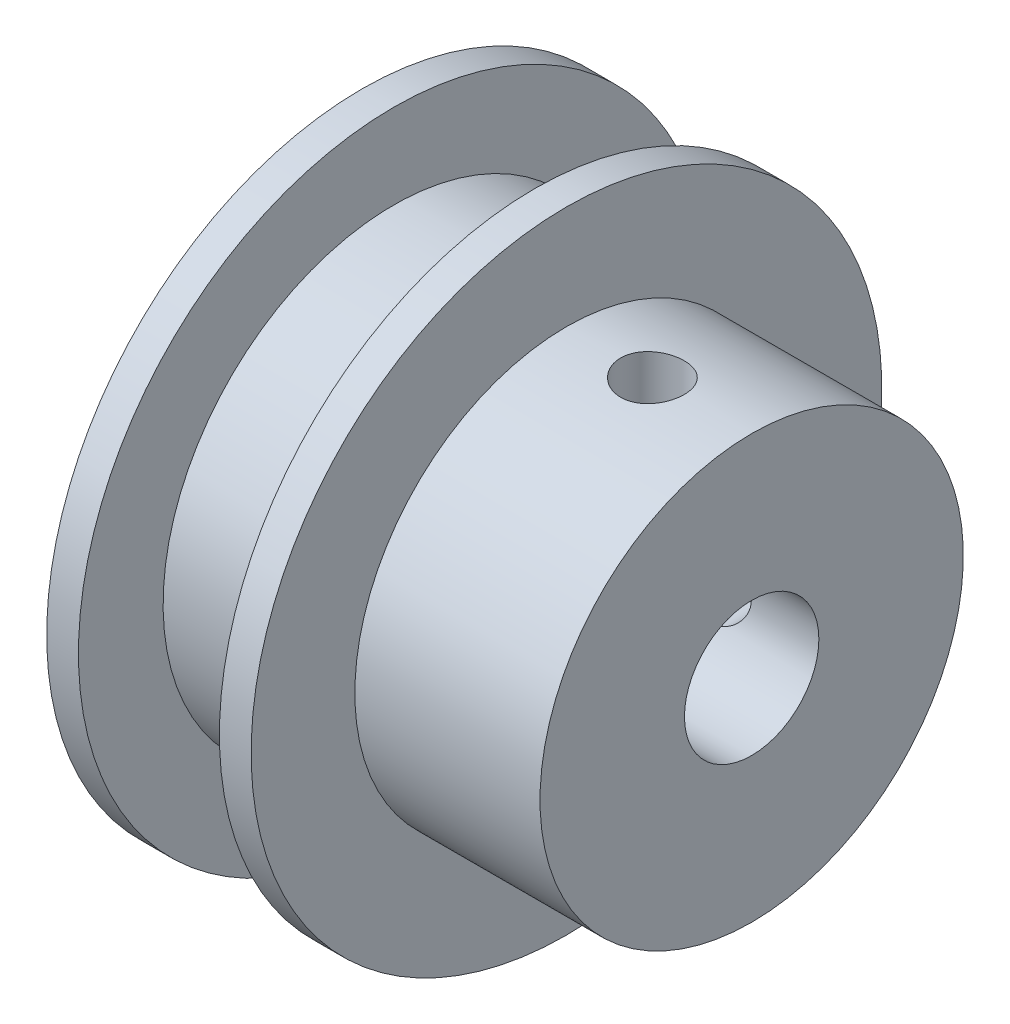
ISO-10303-21;
HEADER;
FILE_DESCRIPTION(('STEP AP214'),'2;1');
FILE_NAME('part.step','',(''),(''),'','','');
FILE_SCHEMA(('AUTOMOTIVE_DESIGN { 1 0 10303 214 1 1 1 1 }'));
ENDSEC;
DATA;
#1=APPLICATION_CONTEXT('core data for automotive mechanical design processes');
#2=APPLICATION_PROTOCOL_DEFINITION('international standard','automotive_design',2000,#1);
#3=PRODUCT_CONTEXT('',#1,'mechanical');
#4=PRODUCT('Part','Part','',(#3));
#5=PRODUCT_RELATED_PRODUCT_CATEGORY('part','',(#4));
#6=PRODUCT_DEFINITION_FORMATION('','',#4);
#7=PRODUCT_DEFINITION_CONTEXT('part definition',#1,'design');
#8=PRODUCT_DEFINITION('design','',#6,#7);
#9=PRODUCT_DEFINITION_SHAPE('','',#8);
#10=(LENGTH_UNIT() NAMED_UNIT(*) SI_UNIT(.MILLI.,.METRE.));
#11=(NAMED_UNIT(*) PLANE_ANGLE_UNIT() SI_UNIT($,.RADIAN.));
#12=(NAMED_UNIT(*) SI_UNIT($,.STERADIAN.) SOLID_ANGLE_UNIT());
#13=UNCERTAINTY_MEASURE_WITH_UNIT(LENGTH_MEASURE(1.E-05),#10,'distance_accuracy_value','');
#14=(GEOMETRIC_REPRESENTATION_CONTEXT(3) GLOBAL_UNCERTAINTY_ASSIGNED_CONTEXT((#13)) GLOBAL_UNIT_ASSIGNED_CONTEXT((#10,
#11,#12)) REPRESENTATION_CONTEXT('',''));
#15=CARTESIAN_POINT('',(0.,0.,0.));
#16=DIRECTION('',(0.,0.,1.));
#17=DIRECTION('',(1.,0.,0.));
#18=AXIS2_PLACEMENT_3D('',#15,#16,#17);
#19=CARTESIAN_POINT('',(-4.83,-10.9,0.));
#20=DIRECTION('',(-1.,0.,0.));
#21=DIRECTION('',(0.,-1.,0.));
#22=AXIS2_PLACEMENT_3D('',#19,#20,#21);
#23=CYLINDRICAL_SURFACE('',#22,14.9);
#24=CARTESIAN_POINT('',(3.33,-10.9,0.));
#25=DIRECTION('',(-1.,0.,0.));
#26=DIRECTION('',(0.,-1.,0.));
#27=AXIS2_PLACEMENT_3D('',#24,#25,#26);
#28=CIRCLE('',#27,14.9);
#29=CARTESIAN_POINT('',(3.33,-25.8,0.));
#30=VERTEX_POINT('',#29);
#31=EDGE_CURVE('E10',#30,#30,#28,.T.);
#32=ORIENTED_EDGE('',*,*,#31,.F.);
#33=EDGE_LOOP('',(#32));
#34=FACE_BOUND('',#33,.T.);
#35=CARTESIAN_POINT('',(4.83,-10.9,0.));
#36=DIRECTION('',(-1.,0.,0.));
#37=DIRECTION('',(0.,-1.,0.));
#38=AXIS2_PLACEMENT_3D('',#35,#36,#37);
#39=CIRCLE('',#38,14.9);
#40=CARTESIAN_POINT('',(4.83,-25.8,0.));
#41=VERTEX_POINT('',#40);
#42=EDGE_CURVE('E61',#41,#41,#39,.T.);
#43=ORIENTED_EDGE('',*,*,#42,.T.);
#44=EDGE_LOOP('',(#43));
#45=FACE_BOUND('',#44,.T.);
#46=ADVANCED_FACE('F36',(#34,#45),#23,.T.);
#47=CARTESIAN_POINT('',(3.33,4.,0.));
#48=DIRECTION('',(1.,0.,0.));
#49=DIRECTION('',(0.,1.,0.));
#50=AXIS2_PLACEMENT_3D('',#47,#48,#49);
#51=PLANE('',#50);
#52=CARTESIAN_POINT('',(3.33,-10.9,0.));
#53=DIRECTION('',(-1.,0.,0.));
#54=DIRECTION('',(0.,-1.,0.));
#55=AXIS2_PLACEMENT_3D('',#52,#53,#54);
#56=CIRCLE('',#55,10.9);
#57=CARTESIAN_POINT('',(3.33,-21.8,0.));
#58=VERTEX_POINT('',#57);
#59=EDGE_CURVE('E49',#58,#58,#56,.T.);
#60=ORIENTED_EDGE('',*,*,#59,.F.);
#61=EDGE_LOOP('',(#60));
#62=FACE_BOUND('',#61,.T.);
#63=ORIENTED_EDGE('',*,*,#31,.T.);
#64=EDGE_LOOP('',(#63));
#65=FACE_BOUND('',#64,.T.);
#66=ADVANCED_FACE('F107',(#62,#65),#51,.F.);
#67=CARTESIAN_POINT('',(-4.83,-10.9,0.));
#68=DIRECTION('',(-1.,0.,0.));
#69=DIRECTION('',(0.,-1.,0.));
#70=AXIS2_PLACEMENT_3D('',#67,#68,#69);
#71=CYLINDRICAL_SURFACE('',#70,10.9);
#72=CARTESIAN_POINT('',(-3.33,-10.9,0.));
#73=DIRECTION('',(-1.,0.,0.));
#74=DIRECTION('',(0.,-1.,0.));
#75=AXIS2_PLACEMENT_3D('',#72,#73,#74);
#76=CIRCLE('',#75,10.9);
#77=CARTESIAN_POINT('',(-3.33,-21.8,0.));
#78=VERTEX_POINT('',#77);
#79=EDGE_CURVE('E55',#78,#78,#76,.T.);
#80=ORIENTED_EDGE('',*,*,#79,.F.);
#81=EDGE_LOOP('',(#80));
#82=FACE_BOUND('',#81,.T.);
#83=ORIENTED_EDGE('',*,*,#59,.T.);
#84=EDGE_LOOP('',(#83));
#85=FACE_BOUND('',#84,.T.);
#86=ADVANCED_FACE('F104',(#82,#85),#71,.T.);
#87=CARTESIAN_POINT('',(-3.33,0.,0.));
#88=DIRECTION('',(-1.,0.,0.));
#89=DIRECTION('',(0.,-1.,0.));
#90=AXIS2_PLACEMENT_3D('',#87,#88,#89);
#91=PLANE('',#90);
#92=CARTESIAN_POINT('',(-3.33,-10.9,0.));
#93=DIRECTION('',(-1.,0.,0.));
#94=DIRECTION('',(0.,-1.,0.));
#95=AXIS2_PLACEMENT_3D('',#92,#93,#94);
#96=CIRCLE('',#95,14.9);
#97=CARTESIAN_POINT('',(-3.33,-25.8,0.));
#98=VERTEX_POINT('',#97);
#99=EDGE_CURVE('E95',#98,#98,#96,.T.);
#100=ORIENTED_EDGE('',*,*,#99,.F.);
#101=EDGE_LOOP('',(#100));
#102=FACE_BOUND('',#101,.T.);
#103=ORIENTED_EDGE('',*,*,#79,.T.);
#104=EDGE_LOOP('',(#103));
#105=FACE_BOUND('',#104,.T.);
#106=ADVANCED_FACE('F102',(#102,#105),#91,.F.);
#107=CARTESIAN_POINT('',(-4.83,-10.9,0.));
#108=DIRECTION('',(-1.,0.,0.));
#109=DIRECTION('',(0.,-1.,0.));
#110=AXIS2_PLACEMENT_3D('',#107,#108,#109);
#111=CYLINDRICAL_SURFACE('',#110,14.9);
#112=CARTESIAN_POINT('',(-4.83,-10.9,0.));
#113=DIRECTION('',(-1.,0.,0.));
#114=DIRECTION('',(0.,-1.,0.));
#115=AXIS2_PLACEMENT_3D('',#112,#113,#114);
#116=CIRCLE('',#115,14.9);
#117=CARTESIAN_POINT('',(-4.83,-25.8,0.));
#118=VERTEX_POINT('',#117);
#119=EDGE_CURVE('E91',#118,#118,#116,.T.);
#120=ORIENTED_EDGE('',*,*,#119,.F.);
#121=EDGE_LOOP('',(#120));
#122=FACE_BOUND('',#121,.T.);
#123=ORIENTED_EDGE('',*,*,#99,.T.);
#124=EDGE_LOOP('',(#123));
#125=FACE_BOUND('',#124,.T.);
#126=ADVANCED_FACE('F119',(#122,#125),#111,.T.);
#127=CARTESIAN_POINT('',(-4.83,4.,0.));
#128=DIRECTION('',(1.,0.,0.));
#129=DIRECTION('',(0.,1.,0.));
#130=AXIS2_PLACEMENT_3D('',#127,#128,#129);
#131=PLANE('',#130);
#132=CARTESIAN_POINT('',(-4.83,-10.9,0.));
#133=DIRECTION('',(1.,0.,0.));
#134=DIRECTION('',(0.,1.,0.));
#135=AXIS2_PLACEMENT_3D('',#132,#133,#134);
#136=CIRCLE('',#135,3.175);
#137=CARTESIAN_POINT('',(-4.83,-7.725,0.));
#138=VERTEX_POINT('',#137);
#139=EDGE_CURVE('E62',#138,#138,#136,.T.);
#140=ORIENTED_EDGE('',*,*,#139,.T.);
#141=EDGE_LOOP('',(#140));
#142=FACE_BOUND('',#141,.T.);
#143=ORIENTED_EDGE('',*,*,#119,.T.);
#144=EDGE_LOOP('',(#143));
#145=FACE_BOUND('',#144,.T.);
#146=ADVANCED_FACE('F123',(#142,#145),#131,.F.);
#147=CARTESIAN_POINT('',(13.58,-10.9,0.));
#148=DIRECTION('',(-1.,0.,0.));
#149=DIRECTION('',(0.,-1.,0.));
#150=AXIS2_PLACEMENT_3D('',#147,#148,#149);
#151=PLANE('',#150);
#152=CARTESIAN_POINT('',(13.58,-10.9,0.));
#153=DIRECTION('',(-1.,0.,0.));
#154=DIRECTION('',(0.,-1.,0.));
#155=AXIS2_PLACEMENT_3D('',#152,#153,#154);
#156=CIRCLE('',#155,3.175);
#157=CARTESIAN_POINT('',(13.58,-14.075,0.));
#158=VERTEX_POINT('',#157);
#159=EDGE_CURVE('E58',#158,#158,#156,.T.);
#160=ORIENTED_EDGE('',*,*,#159,.T.);
#161=EDGE_LOOP('',(#160));
#162=FACE_BOUND('',#161,.T.);
#163=CARTESIAN_POINT('',(13.58,-10.9,0.));
#164=DIRECTION('',(-1.,0.,0.));
#165=DIRECTION('',(0.,-1.,0.));
#166=AXIS2_PLACEMENT_3D('',#163,#164,#165);
#167=CIRCLE('',#166,9.999999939);
#168=CARTESIAN_POINT('',(13.58,-20.899999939,0.));
#169=VERTEX_POINT('',#168);
#170=EDGE_CURVE('E87',#169,#169,#167,.T.);
#171=ORIENTED_EDGE('',*,*,#170,.F.);
#172=EDGE_LOOP('',(#171));
#173=FACE_BOUND('',#172,.T.);
#174=ADVANCED_FACE('F127',(#162,#173),#151,.F.);
#175=CARTESIAN_POINT('',(-4.83,-10.9,0.));
#176=DIRECTION('',(-1.,0.,0.));
#177=DIRECTION('',(0.,-1.,0.));
#178=AXIS2_PLACEMENT_3D('',#175,#176,#177);
#179=CYLINDRICAL_SURFACE('',#178,9.99999993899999);
#180=CARTESIAN_POINT('',(8.89,-1.01314009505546,1.5));
#181=CARTESIAN_POINT('',(8.80625443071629,-1.01313869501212,1.49999654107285));
#182=CARTESIAN_POINT('',(8.72246024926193,-1.0120645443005,1.49296296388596));
#183=CARTESIAN_POINT('',(8.55721468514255,-1.00788691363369,1.46502196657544));
#184=CARTESIAN_POINT('',(8.47576566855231,-1.00478145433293,1.4441010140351));
#185=CARTESIAN_POINT('',(8.31762624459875,-0.996900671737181,1.38902526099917));
#186=CARTESIAN_POINT('',(8.24093223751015,-0.992126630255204,1.35488061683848));
#187=CARTESIAN_POINT('',(8.09437296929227,-0.981448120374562,1.27435063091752));
#188=CARTESIAN_POINT('',(8.02450676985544,-0.975543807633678,1.22796697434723));
#189=CARTESIAN_POINT('',(7.89301618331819,-0.963217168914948,1.12387902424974));
#190=CARTESIAN_POINT('',(7.83145438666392,-0.956791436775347,1.06609605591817));
#191=CARTESIAN_POINT('',(7.71886251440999,-0.944176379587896,0.941019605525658));
#192=CARTESIAN_POINT('',(7.66783301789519,-0.937987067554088,0.873725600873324));
#193=CARTESIAN_POINT('',(7.57752336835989,-0.926506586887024,0.731136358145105));
#194=CARTESIAN_POINT('',(7.53830084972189,-0.921219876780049,0.655804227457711));
#195=CARTESIAN_POINT('',(7.47308840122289,-0.912177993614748,0.499528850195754));
#196=CARTESIAN_POINT('',(7.44709777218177,-0.908422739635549,0.41858590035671));
#197=CARTESIAN_POINT('',(7.40927661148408,-0.902890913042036,0.254031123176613));
#198=CARTESIAN_POINT('',(7.39734127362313,-0.901099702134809,0.170443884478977));
#199=CARTESIAN_POINT('',(7.38764406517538,-0.899647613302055,0.0024352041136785));
#200=CARTESIAN_POINT('',(7.38988140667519,-0.899986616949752,-0.0819861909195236));
#201=CARTESIAN_POINT('',(7.40838333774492,-0.902745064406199,-0.248551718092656));
#202=CARTESIAN_POINT('',(7.42453517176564,-0.905147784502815,-0.330708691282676));
#203=CARTESIAN_POINT('',(7.47023060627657,-0.911745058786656,-0.491132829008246));
#204=CARTESIAN_POINT('',(7.4997745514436,-0.915939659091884,-0.569399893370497));
#205=CARTESIAN_POINT('',(7.57153099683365,-0.9256781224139,-0.720163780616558));
#206=CARTESIAN_POINT('',(7.61379096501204,-0.931227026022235,-0.792637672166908));
#207=CARTESIAN_POINT('',(7.70974519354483,-0.943055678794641,-0.929507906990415));
#208=CARTESIAN_POINT('',(7.7634402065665,-0.949335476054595,-0.993903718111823));
#209=CARTESIAN_POINT('',(7.88136844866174,-0.961998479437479,-1.11345448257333));
#210=CARTESIAN_POINT('',(7.94570012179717,-0.968382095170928,-1.16851232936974));
#211=CARTESIAN_POINT('',(8.08274107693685,-0.980473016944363,-1.26706599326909));
#212=CARTESIAN_POINT('',(8.15545041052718,-0.986180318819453,-1.31056173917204));
#213=CARTESIAN_POINT('',(8.30728396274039,-0.996272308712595,-1.38476964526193));
#214=CARTESIAN_POINT('',(8.38641313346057,-1.00065596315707,-1.41547182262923));
#215=CARTESIAN_POINT('',(8.54878525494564,-1.00758603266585,-1.46312336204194));
#216=CARTESIAN_POINT('',(8.63202791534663,-1.0101325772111,-1.48007369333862));
#217=CARTESIAN_POINT('',(8.79940008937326,-1.01307554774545,-1.4996072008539));
#218=CARTESIAN_POINT('',(8.88351318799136,-1.01349257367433,-1.50232803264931));
#219=CARTESIAN_POINT('',(9.0509941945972,-1.0121839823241,-1.4936905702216));
#220=CARTESIAN_POINT('',(9.13436212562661,-1.01045843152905,-1.48233271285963));
#221=CARTESIAN_POINT('',(9.29755981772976,-1.0050780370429,-1.44597702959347));
#222=CARTESIAN_POINT('',(9.37740520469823,-1.00143289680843,-1.42104778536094));
#223=CARTESIAN_POINT('',(9.53178409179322,-0.992632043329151,-1.35832831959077));
#224=CARTESIAN_POINT('',(9.6063173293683,-0.987476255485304,-1.32053746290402));
#225=CARTESIAN_POINT('',(9.74857326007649,-0.976186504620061,-1.23283678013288));
#226=CARTESIAN_POINT('',(9.81624044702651,-0.97004546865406,-1.18283784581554));
#227=CARTESIAN_POINT('',(9.94227285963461,-0.95749846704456,-1.07226416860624));
#228=CARTESIAN_POINT('',(10.0006375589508,-0.951092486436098,-1.01168882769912));
#229=CARTESIAN_POINT('',(10.1069026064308,-0.938673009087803,-0.881075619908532));
#230=CARTESIAN_POINT('',(10.1547117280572,-0.932663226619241,-0.810963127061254));
#231=CARTESIAN_POINT('',(10.2378729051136,-0.921771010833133,-0.663622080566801));
#232=CARTESIAN_POINT('',(10.2732253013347,-0.916888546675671,-0.586393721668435));
#233=CARTESIAN_POINT('',(10.3303237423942,-0.90881736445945,-0.427297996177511));
#234=CARTESIAN_POINT('',(10.3521196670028,-0.905622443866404,-0.345448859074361));
#235=CARTESIAN_POINT('',(10.3816478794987,-0.901260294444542,-0.179200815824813));
#236=CARTESIAN_POINT('',(10.3893810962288,-0.900092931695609,-0.0948020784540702));
#237=CARTESIAN_POINT('',(10.3905417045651,-0.899918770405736,0.0732645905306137));
#238=CARTESIAN_POINT('',(10.3841086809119,-0.900890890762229,0.156931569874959));
#239=CARTESIAN_POINT('',(10.3574186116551,-0.904843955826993,0.321979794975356));
#240=CARTESIAN_POINT('',(10.3371616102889,-0.907824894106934,0.403361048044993));
#241=CARTESIAN_POINT('',(10.283448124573,-0.915462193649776,0.561489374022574));
#242=CARTESIAN_POINT('',(10.2500013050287,-0.920117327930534,0.638239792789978));
#243=CARTESIAN_POINT('',(10.1708725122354,-0.930591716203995,0.785061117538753));
#244=CARTESIAN_POINT('',(10.1251901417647,-0.936411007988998,0.855131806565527));
#245=CARTESIAN_POINT('',(10.0223823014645,-0.948634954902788,0.987312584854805));
#246=CARTESIAN_POINT('',(9.96515377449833,-0.955044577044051,1.04934206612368));
#247=CARTESIAN_POINT('',(9.84109492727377,-0.967690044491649,1.16296808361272));
#248=CARTESIAN_POINT('',(9.77426235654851,-0.973925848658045,1.21456216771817));
#249=CARTESIAN_POINT('',(9.63245101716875,-0.985555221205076,1.30611310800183));
#250=CARTESIAN_POINT('',(9.55742858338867,-0.990943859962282,1.34600294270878));
#251=CARTESIAN_POINT('',(9.40170322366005,-1.00021097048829,1.41255613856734));
#252=CARTESIAN_POINT('',(9.32100629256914,-1.00409100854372,1.43923322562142));
#253=CARTESIAN_POINT('',(9.18162256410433,-1.00900520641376,1.47254951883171));
#254=CARTESIAN_POINT('',(9.12379660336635,-1.01054756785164,1.48282769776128));
#255=CARTESIAN_POINT('',(9.00732170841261,-1.01261549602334,1.49655410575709));
#256=CARTESIAN_POINT('',(8.94867278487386,-1.01314107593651,1.50000242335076));
#257=CARTESIAN_POINT('',(8.89,-1.01314009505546,1.5));
#258=B_SPLINE_CURVE_WITH_KNOTS('',3,(#180,#181,#182,#183,#184,#185,#186,#187,#188,#189,#190,
#191,#192,#193,#194,#195,#196,#197,#198,#199,#200,#201,#202,#203,#204,#205,#206,#207,#208,#209,
#210,#211,#212,#213,#214,#215,#216,#217,#218,#219,#220,#221,#222,#223,#224,#225,#226,#227,#228,
#229,#230,#231,#232,#233,#234,#235,#236,#237,#238,#239,#240,#241,#242,#243,#244,#245,#246,#247,
#248,#249,#250,#251,#252,#253,#254,#255,#256,#257),.UNSPECIFIED.,.T.,.F.,(4,2,2,2,2,2,2,2,2,2,2,
2,2,2,2,2,2,2,2,2,2,2,2,2,2,2,2,2,2,2,2,2,2,2,2,2,2,2,4),(0.,0.251022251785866,
0.502289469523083,0.753364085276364,1.00440414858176,1.25724158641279,1.51009292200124,
1.76415922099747,2.01821209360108,2.27035832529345,2.52249053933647,2.77259862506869,
3.02271314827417,3.27377316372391,3.52484970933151,3.77839544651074,4.03194274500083,
4.28568751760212,4.53941440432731,4.79068214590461,5.04194209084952,5.29194394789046,
5.5419581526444,5.79385485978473,6.04576581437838,6.29977537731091,6.55377799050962,
6.8068404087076,7.05988611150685,7.31044963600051,7.56101235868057,7.81139182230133,
8.06177941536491,8.31450949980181,8.567298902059,8.82150878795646,9.07545403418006,
9.25132441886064,9.42719252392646),.UNSPECIFIED.);
#259=CARTESIAN_POINT('',(8.89,-1.01314009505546,1.5));
#260=VERTEX_POINT('',#259);
#261=EDGE_CURVE('E136',#260,#260,#258,.T.);
#262=ORIENTED_EDGE('',*,*,#261,.T.);
#263=EDGE_LOOP('',(#262));
#264=FACE_BOUND('',#263,.T.);
#265=CARTESIAN_POINT('',(10.39,-10.9,-9.99999993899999));
#266=CARTESIAN_POINT('',(10.3899965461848,-10.9837515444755,-9.99999859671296));
#267=CARTESIAN_POINT('',(10.3829619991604,-11.0675516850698,-9.99893676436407));
#268=CARTESIAN_POINT('',(10.3550168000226,-11.2328096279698,-9.99480309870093));
#269=CARTESIAN_POINT('',(10.3340926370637,-11.3142650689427,-9.9917293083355));
#270=CARTESIAN_POINT('',(10.2790074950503,-11.4724180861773,-9.9839171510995));
#271=CARTESIAN_POINT('',(10.244856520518,-11.5491192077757,-9.97918004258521));
#272=CARTESIAN_POINT('',(10.1643116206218,-11.6956904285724,-9.96856469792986));
#273=CARTESIAN_POINT('',(10.11791939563,-11.7655614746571,-9.96268662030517));
#274=CARTESIAN_POINT('',(10.0138227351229,-11.8970467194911,-9.95039164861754));
#275=CARTESIAN_POINT('',(9.95604154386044,-11.9585998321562,-9.94397127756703));
#276=CARTESIAN_POINT('',(9.83097231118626,-12.0711749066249,-9.93134254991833));
#277=CARTESIAN_POINT('',(9.76368372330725,-12.1221962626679,-9.92513420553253));
#278=CARTESIAN_POINT('',(9.62109935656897,-12.2124972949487,-9.91359871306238));
#279=CARTESIAN_POINT('',(9.54576575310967,-12.2517178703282,-9.90827605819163));
#280=CARTESIAN_POINT('',(9.38948717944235,-12.3169263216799,-9.89916205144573));
#281=CARTESIAN_POINT('',(9.3085425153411,-12.3429149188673,-9.89537061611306));
#282=CARTESIAN_POINT('',(9.14398195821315,-12.3807319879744,-9.88978250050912));
#283=CARTESIAN_POINT('',(9.0603906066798,-12.392665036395,-9.88797109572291));
#284=CARTESIAN_POINT('',(8.89237383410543,-12.4023562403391,-9.88650342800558));
#285=CARTESIAN_POINT('',(8.80794846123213,-12.400115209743,-9.88684704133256));
#286=CARTESIAN_POINT('',(8.64139891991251,-12.3816073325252,-9.88963712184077));
#287=CARTESIAN_POINT('',(8.55926147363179,-12.3654569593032,-9.89206612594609));
#288=CARTESIAN_POINT('',(8.39887563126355,-12.3197711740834,-9.89872601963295));
#289=CARTESIAN_POINT('',(8.32062734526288,-12.2902353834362,-9.90295696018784));
#290=CARTESIAN_POINT('',(8.16988662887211,-12.2184960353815,-9.91276329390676));
#291=CARTESIAN_POINT('',(8.09741803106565,-12.1762431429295,-9.91834390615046));
#292=CARTESIAN_POINT('',(7.96055540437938,-12.0803041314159,-9.93021701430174));
#293=CARTESIAN_POINT('',(7.89616190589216,-12.0266172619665,-9.93650955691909));
#294=CARTESIAN_POINT('',(7.776602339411,-11.9086949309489,-9.94917466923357));
#295=CARTESIAN_POINT('',(7.72153500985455,-11.8443593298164,-9.9555474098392));
#296=CARTESIAN_POINT('',(7.62296406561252,-11.7073070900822,-9.96759641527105));
#297=CARTESIAN_POINT('',(7.5794605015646,-11.6345904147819,-9.97327267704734));
#298=CARTESIAN_POINT('',(7.50524691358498,-11.4827545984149,-9.9832950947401));
#299=CARTESIAN_POINT('',(7.47454450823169,-11.4036316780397,-9.98764045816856));
#300=CARTESIAN_POINT('',(7.42689061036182,-11.2412731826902,-9.99450484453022));
#301=CARTESIAN_POINT('',(7.40993818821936,-11.1580378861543,-9.99702399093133));
#302=CARTESIAN_POINT('',(7.39039677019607,-10.9906695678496,-9.99993575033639));
#303=CARTESIAN_POINT('',(7.3876720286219,-10.9065527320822,-10.0003484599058));
#304=CARTESIAN_POINT('',(7.39630300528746,-10.7390633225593,-9.99905554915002));
#305=CARTESIAN_POINT('',(7.40765828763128,-10.6556907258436,-9.997349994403));
#306=CARTESIAN_POINT('',(7.44401410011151,-10.4924676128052,-9.99202462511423));
#307=CARTESIAN_POINT('',(7.46894849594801,-10.4126020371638,-9.98841409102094));
#308=CARTESIAN_POINT('',(7.53168499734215,-10.2581850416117,-9.97968229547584));
#309=CARTESIAN_POINT('',(7.56948770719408,-10.1836338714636,-9.97456096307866));
#310=CARTESIAN_POINT('',(7.65720622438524,-10.0413650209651,-9.96332676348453));
#311=CARTESIAN_POINT('',(7.70720813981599,-9.97370099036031,-9.95720695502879));
#312=CARTESIAN_POINT('',(7.81778581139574,-9.84767632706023,-9.94467856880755));
#313=CARTESIAN_POINT('',(7.87836218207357,-9.78931623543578,-9.93826997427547));
#314=CARTESIAN_POINT('',(8.00897353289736,-9.68306215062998,-9.92582258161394));
#315=CARTESIAN_POINT('',(8.0790829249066,-9.63525915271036,-9.91978729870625));
#316=CARTESIAN_POINT('',(8.22641604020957,-9.55210870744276,-9.9088321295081));
#317=CARTESIAN_POINT('',(8.30363957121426,-9.51676092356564,-9.90391221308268));
#318=CARTESIAN_POINT('',(8.4627375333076,-9.45966532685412,-9.89577026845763));
#319=CARTESIAN_POINT('',(8.54459446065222,-9.43786962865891,-9.89254226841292));
#320=CARTESIAN_POINT('',(8.71085901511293,-9.40834450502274,-9.88813376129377));
#321=CARTESIAN_POINT('',(8.79526646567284,-9.40061410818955,-9.8869531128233));
#322=CARTESIAN_POINT('',(8.96332906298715,-9.39946213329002,-9.88677826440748));
#323=CARTESIAN_POINT('',(9.04698324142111,-9.40589747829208,-9.88776220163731));
#324=CARTESIAN_POINT('',(9.21200526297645,-9.43258770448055,-9.89175814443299));
#325=CARTESIAN_POINT('',(9.29337310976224,-9.45284256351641,-9.89477014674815));
#326=CARTESIAN_POINT('',(9.45147308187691,-9.50654626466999,-9.90247519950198));
#327=CARTESIAN_POINT('',(9.52820867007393,-9.5399851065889,-9.90716697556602));
#328=CARTESIAN_POINT('',(9.67500363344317,-9.61909332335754,-9.91770448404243));
#329=CARTESIAN_POINT('',(9.74506278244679,-9.66476311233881,-9.92355025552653));
#330=CARTESIAN_POINT('',(9.87724305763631,-9.76755662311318,-9.93580737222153));
#331=CARTESIAN_POINT('',(9.93928133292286,-9.82478630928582,-9.94222361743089));
#332=CARTESIAN_POINT('',(10.0529245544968,-9.9488511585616,-9.95485782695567));
#333=CARTESIAN_POINT('',(10.1045270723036,-10.015688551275,-9.96107574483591));
#334=CARTESIAN_POINT('',(10.1960876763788,-10.1575042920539,-9.9726517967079));
#335=CARTESIAN_POINT('',(10.2359801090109,-10.2325254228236,-9.97800501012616));
#336=CARTESIAN_POINT('',(10.3025385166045,-10.3882481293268,-9.98720022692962));
#337=CARTESIAN_POINT('',(10.3292181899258,-10.4689437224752,-9.99104379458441));
#338=CARTESIAN_POINT('',(10.3625413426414,-10.6083342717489,-9.99590933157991));
#339=CARTESIAN_POINT('',(10.3728226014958,-10.6661688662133,-9.99743543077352));
#340=CARTESIAN_POINT('',(10.386553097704,-10.7826610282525,-9.99948119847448));
#341=CARTESIAN_POINT('',(10.3900024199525,-10.8413185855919,-10.0000008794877));
#342=CARTESIAN_POINT('',(10.39,-10.9,-9.99999993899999));
#343=B_SPLINE_CURVE_WITH_KNOTS('',3,(#265,#266,#267,#268,#269,#270,#271,#272,#273,#274,#275,
#276,#277,#278,#279,#280,#281,#282,#283,#284,#285,#286,#287,#288,#289,#290,#291,#292,#293,#294,
#295,#296,#297,#298,#299,#300,#301,#302,#303,#304,#305,#306,#307,#308,#309,#310,#311,#312,#313,
#314,#315,#316,#317,#318,#319,#320,#321,#322,#323,#324,#325,#326,#327,#328,#329,#330,#331,#332,
#333,#334,#335,#336,#337,#338,#339,#340,#341,#342),.UNSPECIFIED.,.T.,.F.,(4,2,2,2,2,2,2,2,2,2,2,
2,2,2,2,2,2,2,2,2,2,2,2,2,2,2,2,2,2,2,2,2,2,2,2,2,2,2,4),(0.,0.251040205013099,
0.502324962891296,0.753420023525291,1.00448022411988,1.25729416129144,1.51012263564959,
1.76419702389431,2.01825756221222,2.27041564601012,2.52255925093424,2.77261177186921,
3.02267136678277,3.27371383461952,3.52477278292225,3.77834291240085,4.03191415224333,
4.28563608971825,4.53934087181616,4.79062058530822,5.04189251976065,5.29195148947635,
5.5420222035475,5.79391188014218,6.04581620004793,6.29981366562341,6.55380426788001,
6.80689223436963,7.05996272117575,7.31048888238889,7.56101464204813,7.81135073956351,
8.06169531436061,8.31444829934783,8.56726003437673,8.8214632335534,9.07540233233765,
9.251298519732,9.42719252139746),.UNSPECIFIED.);
#344=CARTESIAN_POINT('',(10.39,-10.9,-9.99999993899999));
#345=VERTEX_POINT('',#344);
#346=EDGE_CURVE('E76',#345,#345,#343,.T.);
#347=ORIENTED_EDGE('',*,*,#346,.F.);
#348=EDGE_LOOP('',(#347));
#349=FACE_BOUND('',#348,.T.);
#350=CARTESIAN_POINT('',(4.83,-10.9,0.));
#351=DIRECTION('',(-1.,0.,0.));
#352=DIRECTION('',(0.,-1.,0.));
#353=AXIS2_PLACEMENT_3D('',#350,#351,#352);
#354=CIRCLE('',#353,9.99999993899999);
#355=CARTESIAN_POINT('',(4.83,-20.899999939,0.));
#356=VERTEX_POINT('',#355);
#357=EDGE_CURVE('E68',#356,#356,#354,.T.);
#358=ORIENTED_EDGE('',*,*,#357,.F.);
#359=EDGE_LOOP('',(#358));
#360=FACE_BOUND('',#359,.T.);
#361=ORIENTED_EDGE('',*,*,#170,.T.);
#362=EDGE_LOOP('',(#361));
#363=FACE_BOUND('',#362,.T.);
#364=ADVANCED_FACE('F130',(#264,#349,#360,#363),#179,.T.);
#365=CARTESIAN_POINT('',(4.83,-0.900000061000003,0.));
#366=DIRECTION('',(-1.,0.,0.));
#367=DIRECTION('',(0.,-1.,0.));
#368=AXIS2_PLACEMENT_3D('',#365,#366,#367);
#369=PLANE('',#368);
#370=ORIENTED_EDGE('',*,*,#42,.F.);
#371=EDGE_LOOP('',(#370));
#372=FACE_BOUND('',#371,.T.);
#373=ORIENTED_EDGE('',*,*,#357,.T.);
#374=EDGE_LOOP('',(#373));
#375=FACE_BOUND('',#374,.T.);
#376=ADVANCED_FACE('F134',(#372,#375),#369,.F.);
#377=CARTESIAN_POINT('',(-4.83,-10.9,0.));
#378=DIRECTION('',(1.,0.,0.));
#379=DIRECTION('',(0.,1.,0.));
#380=AXIS2_PLACEMENT_3D('',#377,#378,#379);
#381=CYLINDRICAL_SURFACE('',#380,3.175);
#382=CARTESIAN_POINT('',(8.89,-8.1016746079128,1.5));
#383=CARTESIAN_POINT('',(8.81118925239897,-8.10166902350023,1.49999523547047));
#384=CARTESIAN_POINT('',(8.73226438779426,-8.09829572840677,1.49374832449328));
#385=CARTESIAN_POINT('',(8.57678533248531,-8.08527355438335,1.4690554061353));
#386=CARTESIAN_POINT('',(8.5002370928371,-8.07561007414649,1.45058101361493));
#387=CARTESIAN_POINT('',(8.35204732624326,-8.05136990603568,1.40237253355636));
#388=CARTESIAN_POINT('',(8.28038386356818,-8.03681720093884,1.37269332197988));
#389=CARTESIAN_POINT('',(8.14307060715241,-8.00447497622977,1.30308399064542));
#390=CARTESIAN_POINT('',(8.0774205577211,-7.98668559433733,1.26315430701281));
#391=CARTESIAN_POINT('',(7.9486767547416,-7.94827772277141,1.1707430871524));
#392=CARTESIAN_POINT('',(7.88612211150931,-7.92754745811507,1.11755658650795));
#393=CARTESIAN_POINT('',(7.77040856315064,-7.88650048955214,1.00161259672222));
#394=CARTESIAN_POINT('',(7.71725393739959,-7.86618397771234,0.938850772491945));
#395=CARTESIAN_POINT('',(7.61881062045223,-7.82682711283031,0.801034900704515));
#396=CARTESIAN_POINT('',(7.57416549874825,-7.80793133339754,0.725476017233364));
#397=CARTESIAN_POINT('',(7.49846247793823,-7.77496618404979,0.566861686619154));
#398=CARTESIAN_POINT('',(7.46739690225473,-7.76089408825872,0.483810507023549));
#399=CARTESIAN_POINT('',(7.42180568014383,-7.73996249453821,0.318263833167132));
#400=CARTESIAN_POINT('',(7.4063401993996,-7.73269535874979,0.23607983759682));
#401=CARTESIAN_POINT('',(7.38931330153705,-7.72468499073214,0.0699854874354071));
#402=CARTESIAN_POINT('',(7.38774448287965,-7.72393828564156,-0.0139239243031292));
#403=CARTESIAN_POINT('',(7.39814689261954,-7.7288430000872,-0.174104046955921));
#404=CARTESIAN_POINT('',(7.4090736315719,-7.73400089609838,-0.250460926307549));
#405=CARTESIAN_POINT('',(7.44231548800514,-7.74941286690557,-0.400106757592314));
#406=CARTESIAN_POINT('',(7.46463145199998,-7.75966732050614,-0.473395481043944));
#407=CARTESIAN_POINT('',(7.52021819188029,-7.78450616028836,-0.61616215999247));
#408=CARTESIAN_POINT('',(7.55364599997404,-7.79915230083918,-0.685567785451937));
#409=CARTESIAN_POINT('',(7.63031903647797,-7.83141518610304,-0.817962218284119));
#410=CARTESIAN_POINT('',(7.67356786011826,-7.84903301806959,-0.880948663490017));
#411=CARTESIAN_POINT('',(7.77298223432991,-7.88734810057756,-1.00453666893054));
#412=CARTESIAN_POINT('',(7.82994263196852,-7.9081799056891,-1.0644578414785));
#413=CARTESIAN_POINT('',(7.95300294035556,-7.94953716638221,-1.17424124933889));
#414=CARTESIAN_POINT('',(8.01910854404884,-7.97006242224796,-1.2240971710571));
#415=CARTESIAN_POINT('',(8.16282786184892,-8.00960288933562,-1.31484174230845));
#416=CARTESIAN_POINT('',(8.2408610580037,-8.02848422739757,-1.35512986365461));
#417=CARTESIAN_POINT('',(8.40371625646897,-8.06085165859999,-1.42170562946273));
#418=CARTESIAN_POINT('',(8.48853178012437,-8.07434282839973,-1.44800645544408));
#419=CARTESIAN_POINT('',(8.6557462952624,-8.0930202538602,-1.48387059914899));
#420=CARTESIAN_POINT('',(8.73784244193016,-8.09875772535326,-1.4945499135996));
#421=CARTESIAN_POINT('',(8.90283645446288,-8.10285765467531,-1.50221328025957));
#422=CARTESIAN_POINT('',(8.98573385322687,-8.10122417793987,-1.49920488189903));
#423=CARTESIAN_POINT('',(9.14184110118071,-8.09134715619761,-1.4806017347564));
#424=CARTESIAN_POINT('',(9.21523813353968,-8.08372855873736,-1.46619608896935));
#425=CARTESIAN_POINT('',(9.35846363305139,-8.06362051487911,-1.42690562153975));
#426=CARTESIAN_POINT('',(9.42829107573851,-8.0511296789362,-1.40201781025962));
#427=CARTESIAN_POINT('',(9.56603580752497,-8.02199685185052,-1.3412324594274));
#428=CARTESIAN_POINT('',(9.63371599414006,-8.00518980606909,-1.30487958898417));
#429=CARTESIAN_POINT('',(9.76238982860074,-7.96949492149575,-1.22260967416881));
#430=CARTESIAN_POINT('',(9.82338011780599,-7.95060604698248,-1.17668785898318));
#431=CARTESIAN_POINT('',(9.94395122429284,-7.91037466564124,-1.07066250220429));
#432=CARTESIAN_POINT('',(10.0026390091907,-7.8889908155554,-1.00955462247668));
#433=CARTESIAN_POINT('',(10.1091662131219,-7.84802183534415,-0.877952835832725));
#434=CARTESIAN_POINT('',(10.1570031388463,-7.82843711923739,-0.807456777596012));
#435=CARTESIAN_POINT('',(10.241063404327,-7.79282741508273,-0.657374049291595));
#436=CARTESIAN_POINT('',(10.2770824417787,-7.77686638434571,-0.577656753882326));
#437=CARTESIAN_POINT('',(10.3348659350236,-7.75077906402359,-0.412327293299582));
#438=CARTESIAN_POINT('',(10.3566415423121,-7.74064821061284,-0.326719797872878));
#439=CARTESIAN_POINT('',(10.3836388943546,-7.72802028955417,-0.159896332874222));
#440=CARTESIAN_POINT('',(10.3901101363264,-7.72494766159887,-0.0789253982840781));
#441=CARTESIAN_POINT('',(10.3898871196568,-7.72505363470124,0.0829833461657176));
#442=CARTESIAN_POINT('',(10.3831965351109,-7.72823049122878,0.163921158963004));
#443=CARTESIAN_POINT('',(10.3577084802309,-7.74014589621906,0.318841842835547));
#444=CARTESIAN_POINT('',(10.3395919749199,-7.74857131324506,0.392963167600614));
#445=CARTESIAN_POINT('',(10.2926210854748,-7.76989867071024,0.537026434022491));
#446=CARTESIAN_POINT('',(10.2637649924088,-7.7828013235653,0.60696770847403));
#447=CARTESIAN_POINT('',(10.1947349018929,-7.81261489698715,0.744198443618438));
#448=CARTESIAN_POINT('',(10.1541093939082,-7.8296802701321,0.811226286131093));
#449=CARTESIAN_POINT('',(10.0632843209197,-7.86594522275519,0.937805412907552));
#450=CARTESIAN_POINT('',(10.0130804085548,-7.88514576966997,0.997353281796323));
#451=CARTESIAN_POINT('',(9.89928446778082,-7.92574250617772,1.11287613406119));
#452=CARTESIAN_POINT('',(9.8348963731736,-7.9471814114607,1.16805442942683));
#453=CARTESIAN_POINT('',(9.69731214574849,-7.98828666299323,1.26705651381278));
#454=CARTESIAN_POINT('',(9.62410959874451,-8.00795169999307,1.31087196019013));
#455=CARTESIAN_POINT('',(9.4692324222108,-8.04336445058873,1.3863737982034));
#456=CARTESIAN_POINT('',(9.38743935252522,-8.05904324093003,1.41785130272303));
#457=CARTESIAN_POINT('',(9.21881199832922,-8.08364371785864,1.4661232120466));
#458=CARTESIAN_POINT('',(9.13199569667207,-8.09258807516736,1.48296690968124));
#459=CARTESIAN_POINT('',(9.01869463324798,-8.09883570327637,1.49469268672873));
#460=CARTESIAN_POINT('',(8.99301180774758,-8.09989739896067,1.49668048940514));
#461=CARTESIAN_POINT('',(8.94155672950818,-8.10131778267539,1.49933495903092));
#462=CARTESIAN_POINT('',(8.91578447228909,-8.10167643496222,1.50000155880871));
#463=CARTESIAN_POINT('',(8.89,-8.1016746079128,1.5));
#464=B_SPLINE_CURVE_WITH_KNOTS('',3,(#382,#383,#384,#385,#386,#387,#388,#389,#390,#391,#392,
#393,#394,#395,#396,#397,#398,#399,#400,#401,#402,#403,#404,#405,#406,#407,#408,#409,#410,#411,
#412,#413,#414,#415,#416,#417,#418,#419,#420,#421,#422,#423,#424,#425,#426,#427,#428,#429,#430,
#431,#432,#433,#434,#435,#436,#437,#438,#439,#440,#441,#442,#443,#444,#445,#446,#447,#448,#449,
#450,#451,#452,#453,#454,#455,#456,#457,#458,#459,#460,#461,#462,#463),.UNSPECIFIED.,.T.,.F.,(4,
2,2,2,2,2,2,2,2,2,2,2,2,2,2,2,2,2,2,2,2,2,2,2,2,2,2,2,2,2,2,2,2,2,2,2,2,2,2,2,4),(0.,
0.236323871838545,0.473198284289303,0.708927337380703,0.944646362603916,1.19762429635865,
1.45071710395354,1.71864285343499,1.98641694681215,2.23687152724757,2.48719270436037,
2.71802817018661,2.94888079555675,3.18314531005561,3.41749572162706,3.67216706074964,
3.92699765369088,4.19506898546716,4.4628872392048,4.71043828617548,4.95785281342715,
5.18239796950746,5.40700721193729,5.64198832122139,5.87708686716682,6.13804637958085,
6.39906579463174,6.66438519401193,6.92949661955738,7.17207877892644,7.41459323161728,
7.64386670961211,7.87317668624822,8.11282240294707,8.35257714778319,8.61378861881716,
8.87519133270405,9.14084608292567,9.40560248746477,9.4829165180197,9.56023447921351),.UNSPECIFIED.);
#465=CARTESIAN_POINT('',(8.89,-8.1016746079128,1.5));
#466=VERTEX_POINT('',#465);
#467=EDGE_CURVE('E144',#466,#466,#464,.T.);
#468=ORIENTED_EDGE('',*,*,#467,.F.);
#469=EDGE_LOOP('',(#468));
#470=FACE_BOUND('',#469,.T.);
#471=CARTESIAN_POINT('',(10.39,-10.9,-3.175));
#472=CARTESIAN_POINT('',(10.3899955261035,-10.9793696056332,-3.17499621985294));
#473=CARTESIAN_POINT('',(10.3836633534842,-11.0588489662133,-3.17199120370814));
#474=CARTESIAN_POINT('',(10.3585996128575,-11.2154907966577,-3.16026762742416));
#475=CARTESIAN_POINT('',(10.3398412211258,-11.2926478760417,-3.15153670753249));
#476=CARTESIAN_POINT('',(10.2908046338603,-11.4421346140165,-3.1292818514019));
#477=CARTESIAN_POINT('',(10.260569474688,-11.514481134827,-3.11577583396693));
#478=CARTESIAN_POINT('',(10.1896444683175,-11.6529827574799,-3.08523557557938));
#479=CARTESIAN_POINT('',(10.1489562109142,-11.719138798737,-3.06820187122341));
#480=CARTESIAN_POINT('',(10.0556866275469,-11.8475319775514,-3.03109215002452));
#481=CARTESIAN_POINT('',(10.0025689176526,-11.909345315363,-3.01089949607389));
#482=CARTESIAN_POINT('',(9.88709401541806,-12.0235687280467,-2.97016877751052));
#483=CARTESIAN_POINT('',(9.82473063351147,-12.0759724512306,-2.94963048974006));
#484=CARTESIAN_POINT('',(9.68748436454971,-12.1734072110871,-2.90895734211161));
#485=CARTESIAN_POINT('',(9.61204154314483,-12.217705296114,-2.88894252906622));
#486=CARTESIAN_POINT('',(9.45371450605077,-12.2927986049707,-2.85350194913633));
#487=CARTESIAN_POINT('',(9.37083518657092,-12.3236026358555,-2.83807319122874));
#488=CARTESIAN_POINT('',(9.20481732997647,-12.3689676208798,-2.81484981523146));
#489=CARTESIAN_POINT('',(9.12195910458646,-12.3843494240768,-2.80667245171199));
#490=CARTESIAN_POINT('',(8.95446669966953,-12.4009699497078,-2.79782290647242));
#491=CARTESIAN_POINT('',(8.86983401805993,-12.4022201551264,-2.79714463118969));
#492=CARTESIAN_POINT('',(8.71062469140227,-12.3911487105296,-2.80305593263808));
#493=CARTESIAN_POINT('',(8.63591684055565,-12.3802236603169,-2.80889771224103));
#494=CARTESIAN_POINT('',(8.48955531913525,-12.347504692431,-2.82589657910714));
#495=CARTESIAN_POINT('',(8.41790246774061,-12.3257078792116,-2.83705508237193));
#496=CARTESIAN_POINT('',(8.27767854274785,-12.2714404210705,-2.86368711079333));
#497=CARTESIAN_POINT('',(8.2092173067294,-12.2387342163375,-2.87925460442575));
#498=CARTESIAN_POINT('',(8.07844422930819,-12.1637503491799,-2.91294481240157));
#499=CARTESIAN_POINT('',(8.01613511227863,-12.1214684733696,-2.93106865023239));
#500=CARTESIAN_POINT('',(7.89211398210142,-12.0230182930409,-2.97027967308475));
#501=CARTESIAN_POINT('',(7.8312446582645,-11.9658268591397,-2.99147184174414));
#502=CARTESIAN_POINT('',(7.71963307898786,-11.8419116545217,-3.03276969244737));
#503=CARTESIAN_POINT('',(7.66889471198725,-11.7751842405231,-3.05287495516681));
#504=CARTESIAN_POINT('',(7.5772344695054,-11.6309004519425,-3.09065813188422));
#505=CARTESIAN_POINT('',(7.5367498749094,-11.5530327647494,-3.10821737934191));
#506=CARTESIAN_POINT('',(7.46976514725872,-11.39054980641,-3.13795896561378));
#507=CARTESIAN_POINT('',(7.44325505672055,-11.3059393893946,-3.15014513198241));
#508=CARTESIAN_POINT('',(7.40695327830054,-11.1393253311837,-3.16698849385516));
#509=CARTESIAN_POINT('',(7.39603697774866,-11.0576180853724,-3.17215069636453));
#510=CARTESIAN_POINT('',(7.38776549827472,-10.8933799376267,-3.17605374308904));
#511=CARTESIAN_POINT('',(7.39040487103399,-10.8108493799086,-3.17479716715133));
#512=CARTESIAN_POINT('',(7.40845895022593,-10.6532090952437,-3.16631250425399));
#513=CARTESIAN_POINT('',(7.42299968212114,-10.5779743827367,-3.15949303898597));
#514=CARTESIAN_POINT('',(7.46312746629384,-10.4311400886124,-3.14106249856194));
#515=CARTESIAN_POINT('',(7.48871579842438,-10.3595409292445,-3.12945086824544));
#516=CARTESIAN_POINT('',(7.55097277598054,-10.2195173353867,-3.10206629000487));
#517=CARTESIAN_POINT('',(7.58795459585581,-10.1512555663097,-3.0861775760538));
#518=CARTESIAN_POINT('',(7.67160542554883,-10.0216665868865,-3.05182842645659));
#519=CARTESIAN_POINT('',(7.71827868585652,-9.96034243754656,-3.0333668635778));
#520=CARTESIAN_POINT('',(7.82484016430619,-9.84055528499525,-2.99374847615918));
#521=CARTESIAN_POINT('',(7.88553803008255,-9.78284178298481,-2.97249840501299));
#522=CARTESIAN_POINT('',(8.0159200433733,-9.6781241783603,-2.9310107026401));
#523=CARTESIAN_POINT('',(8.08560876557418,-9.63112556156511,-2.91077359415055));
#524=CARTESIAN_POINT('',(8.23515860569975,-9.54768226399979,-2.87298422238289));
#525=CARTESIAN_POINT('',(8.31529027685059,-9.5116642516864,-2.85555063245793));
#526=CARTESIAN_POINT('',(8.48157573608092,-9.45400203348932,-2.82679504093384));
#527=CARTESIAN_POINT('',(8.56772253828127,-9.43234145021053,-2.81546607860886));
#528=CARTESIAN_POINT('',(8.73513659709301,-9.40583444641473,-2.80148148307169));
#529=CARTESIAN_POINT('',(8.81613047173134,-9.39963251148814,-2.79812792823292));
#530=CARTESIAN_POINT('',(8.97802567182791,-9.40040088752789,-2.79854075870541));
#531=CARTESIAN_POINT('',(9.05892701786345,-9.4073672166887,-2.80230499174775));
#532=CARTESIAN_POINT('',(9.21186185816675,-9.43304452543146,-2.81582109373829));
#533=CARTESIAN_POINT('',(9.284100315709,-9.45081637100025,-2.82509293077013));
#534=CARTESIAN_POINT('',(9.42452895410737,-9.49652737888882,-2.84807658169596));
#535=CARTESIAN_POINT('',(9.4927179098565,-9.52446960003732,-2.86178973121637));
#536=CARTESIAN_POINT('',(9.62811055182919,-9.59183834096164,-2.89323433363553));
#537=CARTESIAN_POINT('',(9.69494596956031,-9.63190592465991,-2.9111726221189));
#538=CARTESIAN_POINT('',(9.82136079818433,-9.72161930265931,-2.94862781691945));
#539=CARTESIAN_POINT('',(9.88093671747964,-9.77126967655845,-2.96814547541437));
#540=CARTESIAN_POINT('',(9.99755607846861,-9.88481054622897,-3.00898948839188));
#541=CARTESIAN_POINT('',(10.0536938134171,-9.94964445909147,-3.03029315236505));
#542=CARTESIAN_POINT('',(10.1544417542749,-10.0884935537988,-3.07039060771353));
#543=CARTESIAN_POINT('',(10.1990463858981,-10.1625131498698,-3.08918318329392));
#544=CARTESIAN_POINT('',(10.2750463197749,-10.3176896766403,-3.12214803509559));
#545=CARTESIAN_POINT('',(10.3064873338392,-10.3988207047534,-3.13633626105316));
#546=CARTESIAN_POINT('',(10.3549024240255,-10.5659587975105,-3.15849550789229));
#547=CARTESIAN_POINT('',(10.3719192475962,-10.6519506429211,-3.16648489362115));
#548=CARTESIAN_POINT('',(10.3842064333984,-10.7655506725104,-3.17226666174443));
#549=CARTESIAN_POINT('',(10.3863765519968,-10.7923802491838,-3.17328951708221));
#550=CARTESIAN_POINT('',(10.3892741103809,-10.846135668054,-3.17465683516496));
#551=CARTESIAN_POINT('',(10.3900015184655,-10.8730615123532,-3.17500128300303));
#552=CARTESIAN_POINT('',(10.39,-10.9,-3.175));
#553=B_SPLINE_CURVE_WITH_KNOTS('',3,(#471,#472,#473,#474,#475,#476,#477,#478,#479,#480,#481,
#482,#483,#484,#485,#486,#487,#488,#489,#490,#491,#492,#493,#494,#495,#496,#497,#498,#499,#500,
#501,#502,#503,#504,#505,#506,#507,#508,#509,#510,#511,#512,#513,#514,#515,#516,#517,#518,#519,
#520,#521,#522,#523,#524,#525,#526,#527,#528,#529,#530,#531,#532,#533,#534,#535,#536,#537,#538,
#539,#540,#541,#542,#543,#544,#545,#546,#547,#548,#549,#550,#551,#552),.UNSPECIFIED.,.T.,.F.,(4,
2,2,2,2,2,2,2,2,2,2,2,2,2,2,2,2,2,2,2,2,2,2,2,2,2,2,2,2,2,2,2,2,2,2,2,2,2,2,2,4),(0.,
0.237998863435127,0.476513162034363,0.714141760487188,0.951734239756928,1.202566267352,
1.4535669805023,1.72144991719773,1.98915775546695,2.24170968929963,2.49405639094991,
2.72018464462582,2.94637315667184,3.17780125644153,3.40933138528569,3.66670059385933,
3.92416839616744,4.19124985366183,4.45814074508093,4.70459764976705,4.95095550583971,
5.18069145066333,5.41045401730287,5.64720089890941,5.88405183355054,6.14213867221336,
6.40035735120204,6.66760822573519,6.93455372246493,7.17710763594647,7.41958821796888,
7.64352093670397,7.86752106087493,8.1064438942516,8.3454811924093,8.60934561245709,
8.87333732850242,9.13640455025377,9.39868939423,9.47946576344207,9.56024390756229),.UNSPECIFIED.);
#554=CARTESIAN_POINT('',(10.39,-10.9,-3.175));
#555=VERTEX_POINT('',#554);
#556=EDGE_CURVE('E39',#555,#555,#553,.T.);
#557=ORIENTED_EDGE('',*,*,#556,.T.);
#558=EDGE_LOOP('',(#557));
#559=FACE_BOUND('',#558,.T.);
#560=ORIENTED_EDGE('',*,*,#139,.F.);
#561=EDGE_LOOP('',(#560));
#562=FACE_BOUND('',#561,.T.);
#563=ORIENTED_EDGE('',*,*,#159,.F.);
#564=EDGE_LOOP('',(#563));
#565=FACE_BOUND('',#564,.T.);
#566=ADVANCED_FACE('F158',(#470,#559,#562,#565),#381,.F.);
#567=CARTESIAN_POINT('',(8.89,-10.9,-14.901));
#568=DIRECTION('',(0.,0.,1.));
#569=DIRECTION('',(1.,0.,0.));
#570=AXIS2_PLACEMENT_3D('',#567,#568,#569);
#571=CYLINDRICAL_SURFACE('',#570,1.5);
#572=ORIENTED_EDGE('',*,*,#346,.T.);
#573=EDGE_LOOP('',(#572));
#574=FACE_BOUND('',#573,.T.);
#575=ORIENTED_EDGE('',*,*,#556,.F.);
#576=EDGE_LOOP('',(#575));
#577=FACE_BOUND('',#576,.T.);
#578=ADVANCED_FACE('F152',(#574,#577),#571,.F.);
#579=CARTESIAN_POINT('',(8.89,-25.801,0.));
#580=DIRECTION('',(0.,1.,0.));
#581=DIRECTION('',(0.,0.,1.));
#582=AXIS2_PLACEMENT_3D('',#579,#580,#581);
#583=CYLINDRICAL_SURFACE('',#582,1.5);
#584=ORIENTED_EDGE('',*,*,#467,.T.);
#585=EDGE_LOOP('',(#584));
#586=FACE_BOUND('',#585,.T.);
#587=ORIENTED_EDGE('',*,*,#261,.F.);
#588=EDGE_LOOP('',(#587));
#589=FACE_BOUND('',#588,.T.);
#590=ADVANCED_FACE('F149',(#586,#589),#583,.F.);
#591=CLOSED_SHELL('',(#46,#66,#86,#106,#126,#146,#174,#364,#376,#566,#578,#590));
#592=MANIFOLD_SOLID_BREP('B2',#591);
#593=ADVANCED_BREP_SHAPE_REPRESENTATION('',(#18,#592),#14);
#594=SHAPE_DEFINITION_REPRESENTATION(#9,#593);
ENDSEC;
END-ISO-10303-21;
